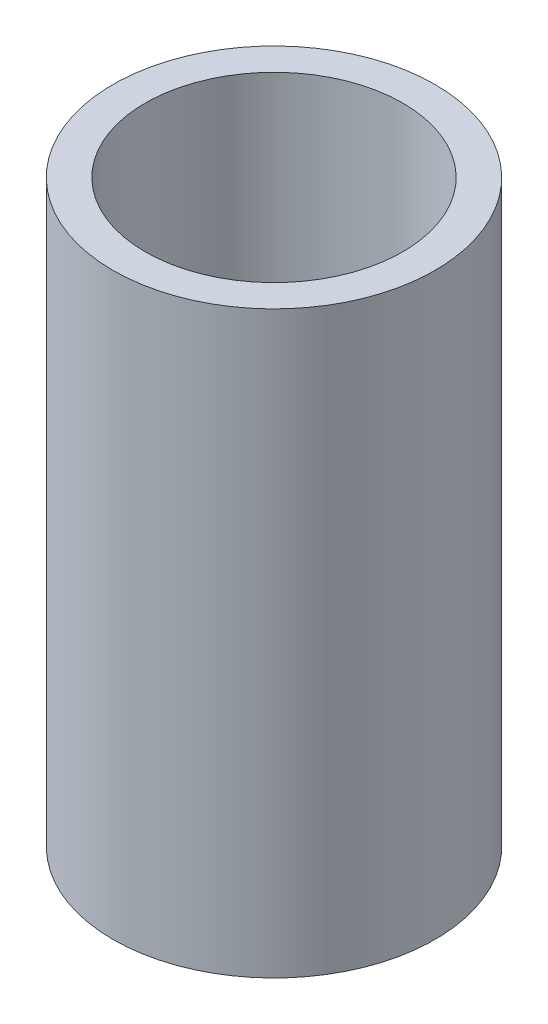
ISO-10303-21;
HEADER;
FILE_DESCRIPTION(('STEP AP214'),'2;1');
FILE_NAME('part.step','',(''),(''),'','','');
FILE_SCHEMA(('AUTOMOTIVE_DESIGN { 1 0 10303 214 1 1 1 1 }'));
ENDSEC;
DATA;
#1=APPLICATION_CONTEXT('core data for automotive mechanical design processes');
#2=APPLICATION_PROTOCOL_DEFINITION('international standard','automotive_design',2000,#1);
#3=PRODUCT_CONTEXT('',#1,'mechanical');
#4=PRODUCT('Part','Part','',(#3));
#5=PRODUCT_RELATED_PRODUCT_CATEGORY('part','',(#4));
#6=PRODUCT_DEFINITION_FORMATION('','',#4);
#7=PRODUCT_DEFINITION_CONTEXT('part definition',#1,'design');
#8=PRODUCT_DEFINITION('design','',#6,#7);
#9=PRODUCT_DEFINITION_SHAPE('','',#8);
#10=(LENGTH_UNIT() NAMED_UNIT(*) SI_UNIT(.MILLI.,.METRE.));
#11=(NAMED_UNIT(*) PLANE_ANGLE_UNIT() SI_UNIT($,.RADIAN.));
#12=(NAMED_UNIT(*) SI_UNIT($,.STERADIAN.) SOLID_ANGLE_UNIT());
#13=UNCERTAINTY_MEASURE_WITH_UNIT(LENGTH_MEASURE(1.E-05),#10,'distance_accuracy_value','');
#14=(GEOMETRIC_REPRESENTATION_CONTEXT(3) GLOBAL_UNCERTAINTY_ASSIGNED_CONTEXT((#13)) GLOBAL_UNIT_ASSIGNED_CONTEXT((#10,
#11,#12)) REPRESENTATION_CONTEXT('',''));
#15=CARTESIAN_POINT('',(0.,0.,0.));
#16=DIRECTION('',(0.,0.,1.));
#17=DIRECTION('',(1.,0.,0.));
#18=AXIS2_PLACEMENT_3D('',#15,#16,#17);
#19=CARTESIAN_POINT('',(0.,152.4,0.));
#20=DIRECTION('',(0.,-1.,0.));
#21=DIRECTION('',(0.,0.,-1.));
#22=AXIS2_PLACEMENT_3D('',#19,#20,#21);
#23=CYLINDRICAL_SURFACE('',#22,63.5240390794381);
#24=CARTESIAN_POINT('',(0.,152.4,0.));
#25=DIRECTION('',(0.,1.,0.));
#26=DIRECTION('',(0.,0.,1.));
#27=AXIS2_PLACEMENT_3D('',#24,#25,#26);
#28=CIRCLE('',#27,63.5240390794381);
#29=CARTESIAN_POINT('',(0.,152.4,-63.5240390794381));
#30=VERTEX_POINT('',#29);
#31=EDGE_CURVE('E10',#30,#30,#28,.T.);
#32=CARTESIAN_POINT('',(0.,-76.2,0.));
#33=DIRECTION('',(0.,1.,0.));
#34=DIRECTION('',(0.,0.,1.));
#35=AXIS2_PLACEMENT_3D('',#32,#33,#34);
#36=CIRCLE('',#35,63.5240390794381);
#37=CARTESIAN_POINT('',(0.,-76.2,-63.5240390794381));
#38=VERTEX_POINT('',#37);
#39=EDGE_CURVE('E32',#38,#38,#36,.T.);
#40=CARTESIAN_POINT('',(0.,152.4,-63.5240390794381));
#41=CARTESIAN_POINT('',(0.,150.01875,-63.5240390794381));
#42=CARTESIAN_POINT('',(0.,147.6375,-63.5240390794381));
#43=CARTESIAN_POINT('',(0.,142.875,-63.5240390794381));
#44=CARTESIAN_POINT('',(0.,140.49375,-63.5240390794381));
#45=CARTESIAN_POINT('',(0.,135.73125,-63.5240390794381));
#46=CARTESIAN_POINT('',(0.,133.35,-63.5240390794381));
#47=CARTESIAN_POINT('',(0.,128.5875,-63.5240390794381));
#48=CARTESIAN_POINT('',(0.,126.20625,-63.5240390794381));
#49=CARTESIAN_POINT('',(0.,121.44375,-63.5240390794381));
#50=CARTESIAN_POINT('',(0.,119.0625,-63.5240390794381));
#51=CARTESIAN_POINT('',(0.,114.3,-63.5240390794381));
#52=CARTESIAN_POINT('',(0.,111.91875,-63.5240390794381));
#53=CARTESIAN_POINT('',(0.,107.15625,-63.5240390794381));
#54=CARTESIAN_POINT('',(0.,104.775,-63.5240390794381));
#55=CARTESIAN_POINT('',(0.,100.0125,-63.5240390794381));
#56=CARTESIAN_POINT('',(0.,97.63125,-63.5240390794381));
#57=CARTESIAN_POINT('',(0.,92.86875,-63.5240390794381));
#58=CARTESIAN_POINT('',(0.,90.4875,-63.5240390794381));
#59=CARTESIAN_POINT('',(0.,85.725,-63.5240390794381));
#60=CARTESIAN_POINT('',(0.,83.34375,-63.5240390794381));
#61=CARTESIAN_POINT('',(0.,78.58125,-63.5240390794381));
#62=CARTESIAN_POINT('',(0.,76.2,-63.5240390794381));
#63=CARTESIAN_POINT('',(0.,71.4375,-63.5240390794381));
#64=CARTESIAN_POINT('',(0.,69.05625,-63.5240390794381));
#65=CARTESIAN_POINT('',(0.,64.29375,-63.5240390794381));
#66=CARTESIAN_POINT('',(0.,61.9125,-63.5240390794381));
#67=CARTESIAN_POINT('',(0.,57.15,-63.5240390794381));
#68=CARTESIAN_POINT('',(0.,54.76875,-63.5240390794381));
#69=CARTESIAN_POINT('',(0.,50.00625,-63.5240390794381));
#70=CARTESIAN_POINT('',(0.,47.625,-63.5240390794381));
#71=CARTESIAN_POINT('',(0.,42.8625,-63.5240390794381));
#72=CARTESIAN_POINT('',(0.,40.48125,-63.5240390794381));
#73=CARTESIAN_POINT('',(0.,35.71875,-63.5240390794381));
#74=CARTESIAN_POINT('',(0.,33.3375,-63.5240390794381));
#75=CARTESIAN_POINT('',(0.,28.575,-63.5240390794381));
#76=CARTESIAN_POINT('',(0.,26.19375,-63.5240390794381));
#77=CARTESIAN_POINT('',(0.,21.43125,-63.5240390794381));
#78=CARTESIAN_POINT('',(0.,19.05,-63.5240390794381));
#79=CARTESIAN_POINT('',(0.,14.2875,-63.5240390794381));
#80=CARTESIAN_POINT('',(0.,11.90625,-63.5240390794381));
#81=CARTESIAN_POINT('',(0.,7.14374999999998,-63.5240390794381));
#82=CARTESIAN_POINT('',(0.,4.76249999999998,-63.5240390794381));
#83=CARTESIAN_POINT('',(0.,0.,-63.5240390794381));
#84=CARTESIAN_POINT('',(0.,-2.38125000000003,-63.5240390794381));
#85=CARTESIAN_POINT('',(0.,-7.14375000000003,-63.5240390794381));
#86=CARTESIAN_POINT('',(0.,-9.52500000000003,-63.5240390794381));
#87=CARTESIAN_POINT('',(0.,-14.2875,-63.5240390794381));
#88=CARTESIAN_POINT('',(0.,-16.66875,-63.5240390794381));
#89=CARTESIAN_POINT('',(0.,-21.43125,-63.5240390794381));
#90=CARTESIAN_POINT('',(0.,-23.8125,-63.5240390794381));
#91=CARTESIAN_POINT('',(0.,-28.575,-63.5240390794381));
#92=CARTESIAN_POINT('',(0.,-30.95625,-63.5240390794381));
#93=CARTESIAN_POINT('',(0.,-35.71875,-63.5240390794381));
#94=CARTESIAN_POINT('',(0.,-38.1,-63.5240390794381));
#95=CARTESIAN_POINT('',(0.,-42.8625,-63.5240390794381));
#96=CARTESIAN_POINT('',(0.,-45.24375,-63.5240390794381));
#97=CARTESIAN_POINT('',(0.,-50.00625,-63.5240390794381));
#98=CARTESIAN_POINT('',(0.,-52.3875,-63.5240390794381));
#99=CARTESIAN_POINT('',(0.,-57.15,-63.5240390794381));
#100=CARTESIAN_POINT('',(0.,-59.53125,-63.5240390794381));
#101=CARTESIAN_POINT('',(0.,-64.29375,-63.5240390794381));
#102=CARTESIAN_POINT('',(0.,-66.675,-63.5240390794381));
#103=CARTESIAN_POINT('',(0.,-71.4375,-63.5240390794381));
#104=CARTESIAN_POINT('',(0.,-73.8187500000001,-63.5240390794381));
#105=CARTESIAN_POINT('',(0.,-76.2,-63.5240390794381));
#106=B_SPLINE_CURVE_WITH_KNOTS('',3,(#40,#41,#42,#43,#44,#45,#46,#47,#48,#49,#50,#51,#52,#53,
#54,#55,#56,#57,#58,#59,#60,#61,#62,#63,#64,#65,#66,#67,#68,#69,#70,#71,#72,#73,#74,#75,#76,#77,
#78,#79,#80,#81,#82,#83,#84,#85,#86,#87,#88,#89,#90,#91,#92,#93,#94,#95,#96,#97,#98,#99,#100,
#101,#102,#103,#104,#105),.UNSPECIFIED.,.F.,.F.,(4,2,2,2,2,2,2,2,2,2,2,2,2,2,2,2,2,2,2,2,2,2,2,
2,2,2,2,2,2,2,2,2,4),(0.,7.14375,14.2875,21.43125,28.575,35.71875,42.8625,50.00625,57.15,
64.29375,71.4375,78.58125,85.725,92.86875,100.0125,107.15625,114.3,121.44375,128.5875,135.73125,
142.875,150.01875,157.1625,164.30625,171.45,178.59375,185.7375,192.88125,200.025,207.16875,
214.3125,221.45625,228.6),.UNSPECIFIED.);
#107=EDGE_CURVE('BSEAM25',#30,#38,#106,.T.);
#108=ORIENTED_EDGE('',*,*,#31,.F.);
#109=ORIENTED_EDGE('',*,*,#39,.T.);
#110=ORIENTED_EDGE('',*,*,#107,.T.);
#111=ORIENTED_EDGE('',*,*,#107,.F.);
#112=EDGE_LOOP('',(#108,#110,#109,#111));
#113=FACE_BOUND('',#112,.T.);
#114=ADVANCED_FACE('F25',(#113),#23,.T.);
#115=CARTESIAN_POINT('',(0.,152.4,0.));
#116=DIRECTION('',(0.,1.,0.));
#117=DIRECTION('',(0.,0.,1.));
#118=AXIS2_PLACEMENT_3D('',#115,#116,#117);
#119=PLANE('',#118);
#120=CARTESIAN_POINT('',(0.,152.4,0.));
#121=DIRECTION('',(0.,1.,0.));
#122=DIRECTION('',(0.,0.,1.));
#123=AXIS2_PLACEMENT_3D('',#120,#121,#122);
#124=CIRCLE('',#123,50.8240390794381);
#125=CARTESIAN_POINT('',(0.,152.4,-50.8240390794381));
#126=VERTEX_POINT('',#125);
#127=EDGE_CURVE('E36',#126,#126,#124,.T.);
#128=ORIENTED_EDGE('',*,*,#127,.F.);
#129=EDGE_LOOP('',(#128));
#130=FACE_BOUND('',#129,.T.);
#131=ORIENTED_EDGE('',*,*,#31,.T.);
#132=EDGE_LOOP('',(#131));
#133=FACE_BOUND('',#132,.T.);
#134=ADVANCED_FACE('F57',(#130,#133),#119,.T.);
#135=CARTESIAN_POINT('',(0.,-76.2,0.));
#136=DIRECTION('',(0.,1.,0.));
#137=DIRECTION('',(0.,0.,1.));
#138=AXIS2_PLACEMENT_3D('',#135,#136,#137);
#139=PLANE('',#138);
#140=ORIENTED_EDGE('',*,*,#39,.F.);
#141=EDGE_LOOP('',(#140));
#142=FACE_BOUND('',#141,.T.);
#143=ADVANCED_FACE('F27',(#142),#139,.F.);
#144=CARTESIAN_POINT('',(0.,152.4,0.));
#145=DIRECTION('',(0.,-1.,0.));
#146=DIRECTION('',(0.,0.,-1.));
#147=AXIS2_PLACEMENT_3D('',#144,#145,#146);
#148=CYLINDRICAL_SURFACE('',#147,50.8240390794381);
#149=CARTESIAN_POINT('',(0.,0.,0.));
#150=DIRECTION('',(0.,1.,0.));
#151=DIRECTION('',(0.,0.,1.));
#152=AXIS2_PLACEMENT_3D('',#149,#150,#151);
#153=CIRCLE('',#152,50.8240390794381);
#154=CARTESIAN_POINT('',(0.,0.,-50.8240390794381));
#155=VERTEX_POINT('',#154);
#156=EDGE_CURVE('E40',#155,#155,#153,.T.);
#157=CARTESIAN_POINT('',(0.,152.4,-50.8240390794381));
#158=CARTESIAN_POINT('',(0.,150.8125,-50.8240390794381));
#159=CARTESIAN_POINT('',(0.,149.225,-50.8240390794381));
#160=CARTESIAN_POINT('',(0.,146.05,-50.8240390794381));
#161=CARTESIAN_POINT('',(0.,144.4625,-50.8240390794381));
#162=CARTESIAN_POINT('',(0.,141.2875,-50.8240390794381));
#163=CARTESIAN_POINT('',(0.,139.7,-50.8240390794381));
#164=CARTESIAN_POINT('',(0.,136.525,-50.8240390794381));
#165=CARTESIAN_POINT('',(0.,134.9375,-50.8240390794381));
#166=CARTESIAN_POINT('',(0.,131.7625,-50.8240390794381));
#167=CARTESIAN_POINT('',(0.,130.175,-50.8240390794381));
#168=CARTESIAN_POINT('',(0.,127.,-50.8240390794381));
#169=CARTESIAN_POINT('',(0.,125.4125,-50.8240390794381));
#170=CARTESIAN_POINT('',(0.,122.2375,-50.8240390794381));
#171=CARTESIAN_POINT('',(0.,120.65,-50.8240390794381));
#172=CARTESIAN_POINT('',(0.,117.475,-50.8240390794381));
#173=CARTESIAN_POINT('',(0.,115.8875,-50.8240390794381));
#174=CARTESIAN_POINT('',(0.,112.7125,-50.8240390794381));
#175=CARTESIAN_POINT('',(0.,111.125,-50.8240390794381));
#176=CARTESIAN_POINT('',(0.,107.95,-50.8240390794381));
#177=CARTESIAN_POINT('',(0.,106.3625,-50.8240390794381));
#178=CARTESIAN_POINT('',(0.,103.1875,-50.8240390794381));
#179=CARTESIAN_POINT('',(0.,101.6,-50.8240390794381));
#180=CARTESIAN_POINT('',(0.,98.425,-50.8240390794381));
#181=CARTESIAN_POINT('',(0.,96.8375,-50.8240390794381));
#182=CARTESIAN_POINT('',(0.,93.6625,-50.8240390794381));
#183=CARTESIAN_POINT('',(0.,92.075,-50.8240390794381));
#184=CARTESIAN_POINT('',(0.,88.9,-50.8240390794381));
#185=CARTESIAN_POINT('',(0.,87.3125,-50.8240390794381));
#186=CARTESIAN_POINT('',(0.,84.1375,-50.8240390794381));
#187=CARTESIAN_POINT('',(0.,82.55,-50.8240390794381));
#188=CARTESIAN_POINT('',(0.,79.375,-50.8240390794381));
#189=CARTESIAN_POINT('',(0.,77.7875,-50.8240390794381));
#190=CARTESIAN_POINT('',(0.,74.6125,-50.8240390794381));
#191=CARTESIAN_POINT('',(0.,73.025,-50.8240390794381));
#192=CARTESIAN_POINT('',(0.,69.85,-50.8240390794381));
#193=CARTESIAN_POINT('',(0.,68.2625,-50.8240390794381));
#194=CARTESIAN_POINT('',(0.,65.0875,-50.8240390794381));
#195=CARTESIAN_POINT('',(0.,63.5,-50.8240390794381));
#196=CARTESIAN_POINT('',(0.,60.325,-50.8240390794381));
#197=CARTESIAN_POINT('',(0.,58.7375,-50.8240390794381));
#198=CARTESIAN_POINT('',(0.,55.5625,-50.8240390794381));
#199=CARTESIAN_POINT('',(0.,53.975,-50.8240390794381));
#200=CARTESIAN_POINT('',(0.,50.8,-50.8240390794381));
#201=CARTESIAN_POINT('',(0.,49.2125,-50.8240390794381));
#202=CARTESIAN_POINT('',(0.,46.0375,-50.8240390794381));
#203=CARTESIAN_POINT('',(0.,44.45,-50.8240390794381));
#204=CARTESIAN_POINT('',(0.,41.275,-50.8240390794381));
#205=CARTESIAN_POINT('',(0.,39.6875,-50.8240390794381));
#206=CARTESIAN_POINT('',(0.,36.5125,-50.8240390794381));
#207=CARTESIAN_POINT('',(0.,34.925,-50.8240390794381));
#208=CARTESIAN_POINT('',(0.,31.75,-50.8240390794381));
#209=CARTESIAN_POINT('',(0.,30.1625,-50.8240390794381));
#210=CARTESIAN_POINT('',(0.,26.9875,-50.8240390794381));
#211=CARTESIAN_POINT('',(0.,25.4,-50.8240390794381));
#212=CARTESIAN_POINT('',(0.,22.225,-50.8240390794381));
#213=CARTESIAN_POINT('',(0.,20.6375,-50.8240390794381));
#214=CARTESIAN_POINT('',(0.,17.4625,-50.8240390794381));
#215=CARTESIAN_POINT('',(0.,15.875,-50.8240390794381));
#216=CARTESIAN_POINT('',(0.,12.7,-50.8240390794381));
#217=CARTESIAN_POINT('',(0.,11.1125,-50.8240390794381));
#218=CARTESIAN_POINT('',(0.,7.93750000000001,-50.8240390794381));
#219=CARTESIAN_POINT('',(0.,6.35,-50.8240390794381));
#220=CARTESIAN_POINT('',(0.,3.175,-50.8240390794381));
#221=CARTESIAN_POINT('',(0.,1.5875,-50.8240390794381));
#222=CARTESIAN_POINT('',(0.,0.,-50.8240390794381));
#223=B_SPLINE_CURVE_WITH_KNOTS('',3,(#157,#158,#159,#160,#161,#162,#163,#164,#165,#166,#167,
#168,#169,#170,#171,#172,#173,#174,#175,#176,#177,#178,#179,#180,#181,#182,#183,#184,#185,#186,
#187,#188,#189,#190,#191,#192,#193,#194,#195,#196,#197,#198,#199,#200,#201,#202,#203,#204,#205,
#206,#207,#208,#209,#210,#211,#212,#213,#214,#215,#216,#217,#218,#219,#220,#221,#222),
.UNSPECIFIED.,.F.,.F.,(4,2,2,2,2,2,2,2,2,2,2,2,2,2,2,2,2,2,2,2,2,2,2,2,2,2,2,2,2,2,2,2,4),(0.,
4.76249999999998,9.52499999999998,14.2875,19.05,23.8125,28.575,33.3375,38.1,42.8625,47.625,
52.3875,57.15,61.9125,66.675,71.4375,76.2,80.9625,85.725,90.4875,95.25,100.0125,104.775,
109.5375,114.3,119.0625,123.825,128.5875,133.35,138.1125,142.875,147.6375,152.4),.UNSPECIFIED.);
#224=EDGE_CURVE('BSEAM48',#126,#155,#223,.T.);
#225=ORIENTED_EDGE('',*,*,#127,.T.);
#226=ORIENTED_EDGE('',*,*,#156,.F.);
#227=ORIENTED_EDGE('',*,*,#224,.T.);
#228=ORIENTED_EDGE('',*,*,#224,.F.);
#229=EDGE_LOOP('',(#225,#227,#226,#228));
#230=FACE_BOUND('',#229,.T.);
#231=ADVANCED_FACE('F48',(#230),#148,.F.);
#232=CARTESIAN_POINT('',(0.,0.,0.));
#233=DIRECTION('',(0.,1.,0.));
#234=DIRECTION('',(0.,0.,1.));
#235=AXIS2_PLACEMENT_3D('',#232,#233,#234);
#236=PLANE('',#235);
#237=ORIENTED_EDGE('',*,*,#156,.T.);
#238=EDGE_LOOP('',(#237));
#239=FACE_BOUND('',#238,.T.);
#240=ADVANCED_FACE('F46',(#239),#236,.T.);
#241=CLOSED_SHELL('',(#114,#134,#143,#231,#240));
#242=MANIFOLD_SOLID_BREP('B2',#241);
#243=ADVANCED_BREP_SHAPE_REPRESENTATION('',(#18,#242),#14);
#244=SHAPE_DEFINITION_REPRESENTATION(#9,#243);
ENDSEC;
END-ISO-10303-21;
